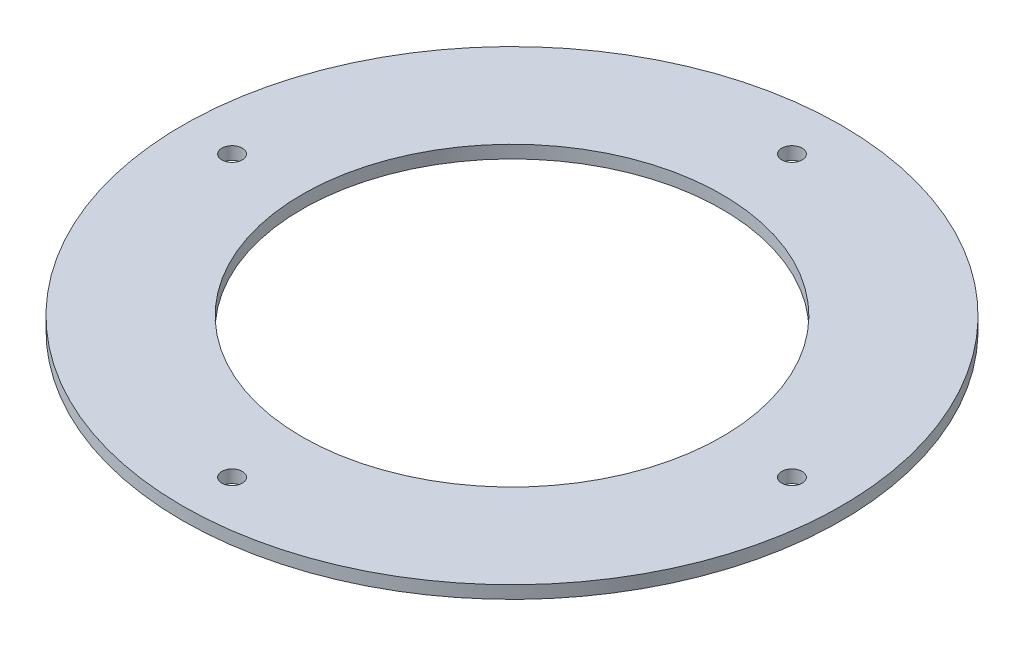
ISO-10303-21;
HEADER;
FILE_DESCRIPTION(('STEP AP214'),'2;1');
FILE_NAME('part.step','',(''),(''),'','','');
FILE_SCHEMA(('AUTOMOTIVE_DESIGN { 1 0 10303 214 1 1 1 1 }'));
ENDSEC;
DATA;
#1=APPLICATION_CONTEXT('core data for automotive mechanical design processes');
#2=APPLICATION_PROTOCOL_DEFINITION('international standard','automotive_design',2000,#1);
#3=PRODUCT_CONTEXT('',#1,'mechanical');
#4=PRODUCT('Part','Part','',(#3));
#5=PRODUCT_RELATED_PRODUCT_CATEGORY('part','',(#4));
#6=PRODUCT_DEFINITION_FORMATION('','',#4);
#7=PRODUCT_DEFINITION_CONTEXT('part definition',#1,'design');
#8=PRODUCT_DEFINITION('design','',#6,#7);
#9=PRODUCT_DEFINITION_SHAPE('','',#8);
#10=(LENGTH_UNIT() NAMED_UNIT(*) SI_UNIT(.MILLI.,.METRE.));
#11=(NAMED_UNIT(*) PLANE_ANGLE_UNIT() SI_UNIT($,.RADIAN.));
#12=(NAMED_UNIT(*) SI_UNIT($,.STERADIAN.) SOLID_ANGLE_UNIT());
#13=UNCERTAINTY_MEASURE_WITH_UNIT(LENGTH_MEASURE(1.E-05),#10,'distance_accuracy_value','');
#14=(GEOMETRIC_REPRESENTATION_CONTEXT(3) GLOBAL_UNCERTAINTY_ASSIGNED_CONTEXT((#13)) GLOBAL_UNIT_ASSIGNED_CONTEXT((#10,
#11,#12)) REPRESENTATION_CONTEXT('',''));
#15=CARTESIAN_POINT('',(0.,0.,0.));
#16=DIRECTION('',(0.,0.,1.));
#17=DIRECTION('',(1.,0.,0.));
#18=AXIS2_PLACEMENT_3D('',#15,#16,#17);
#19=CARTESIAN_POINT('',(0.,3.175,0.));
#20=DIRECTION('',(0.,1.,0.));
#21=DIRECTION('',(0.,0.,1.));
#22=AXIS2_PLACEMENT_3D('',#19,#20,#21);
#23=PLANE('',#22);
#24=CARTESIAN_POINT('',(0.,3.175,-69.85));
#25=DIRECTION('',(0.,1.,0.));
#26=DIRECTION('',(0.,0.,1.));
#27=AXIS2_PLACEMENT_3D('',#24,#25,#26);
#28=CIRCLE('',#27,2.55269999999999);
#29=CARTESIAN_POINT('',(0.,3.175,-67.2973));
#30=VERTEX_POINT('',#29);
#31=EDGE_CURVE('E70',#30,#30,#28,.T.);
#32=ORIENTED_EDGE('',*,*,#31,.F.);
#33=EDGE_LOOP('',(#32));
#34=FACE_BOUND('',#33,.T.);
#35=CARTESIAN_POINT('',(69.85,3.175,2.3566259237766E-13));
#36=DIRECTION('',(0.,1.,0.));
#37=DIRECTION('',(0.,0.,1.));
#38=AXIS2_PLACEMENT_3D('',#35,#36,#37);
#39=CIRCLE('',#38,2.55269999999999);
#40=CARTESIAN_POINT('',(69.85,3.175,2.55270000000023));
#41=VERTEX_POINT('',#40);
#42=EDGE_CURVE('E64',#41,#41,#39,.T.);
#43=ORIENTED_EDGE('',*,*,#42,.F.);
#44=EDGE_LOOP('',(#43));
#45=FACE_BOUND('',#44,.T.);
#46=CARTESIAN_POINT('',(-4.79542563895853E-13,3.175,69.85));
#47=DIRECTION('',(0.,1.,0.));
#48=DIRECTION('',(0.,0.,1.));
#49=AXIS2_PLACEMENT_3D('',#46,#47,#48);
#50=CIRCLE('',#49,2.55269999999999);
#51=CARTESIAN_POINT('',(-4.79542563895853E-13,3.175,72.4027));
#52=VERTEX_POINT('',#51);
#53=EDGE_CURVE('E58',#52,#52,#50,.T.);
#54=ORIENTED_EDGE('',*,*,#53,.F.);
#55=EDGE_LOOP('',(#54));
#56=FACE_BOUND('',#55,.T.);
#57=CARTESIAN_POINT('',(-69.85,3.175,-7.23422535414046E-13));
#58=DIRECTION('',(0.,1.,0.));
#59=DIRECTION('',(0.,0.,1.));
#60=AXIS2_PLACEMENT_3D('',#57,#58,#59);
#61=CIRCLE('',#60,2.55269999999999);
#62=CARTESIAN_POINT('',(-69.85,3.175,2.55269999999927));
#63=VERTEX_POINT('',#62);
#64=EDGE_CURVE('E52',#63,#63,#61,.T.);
#65=ORIENTED_EDGE('',*,*,#64,.F.);
#66=EDGE_LOOP('',(#65));
#67=FACE_BOUND('',#66,.T.);
#68=CARTESIAN_POINT('',(0.,3.175,0.));
#69=DIRECTION('',(0.,1.,0.));
#70=DIRECTION('',(0.,0.,1.));
#71=AXIS2_PLACEMENT_3D('',#68,#69,#70);
#72=CIRCLE('',#71,82.2325);
#73=CARTESIAN_POINT('',(0.,3.175,82.2325));
#74=VERTEX_POINT('',#73);
#75=EDGE_CURVE('E10',#74,#74,#72,.T.);
#76=ORIENTED_EDGE('',*,*,#75,.T.);
#77=EDGE_LOOP('',(#76));
#78=FACE_BOUND('',#77,.T.);
#79=CARTESIAN_POINT('',(0.,3.175,0.));
#80=DIRECTION('',(0.,1.,0.));
#81=DIRECTION('',(0.,0.,1.));
#82=AXIS2_PLACEMENT_3D('',#79,#80,#81);
#83=CIRCLE('',#82,52.3875);
#84=CARTESIAN_POINT('',(0.,3.175,52.3875));
#85=VERTEX_POINT('',#84);
#86=EDGE_CURVE('E42',#85,#85,#83,.T.);
#87=ORIENTED_EDGE('',*,*,#86,.F.);
#88=EDGE_LOOP('',(#87));
#89=FACE_BOUND('',#88,.T.);
#90=ADVANCED_FACE('F31',(#34,#45,#56,#67,#78,#89),#23,.T.);
#91=CARTESIAN_POINT('',(0.,0.,0.));
#92=DIRECTION('',(0.,1.,0.));
#93=DIRECTION('',(0.,0.,1.));
#94=AXIS2_PLACEMENT_3D('',#91,#92,#93);
#95=PLANE('',#94);
#96=CARTESIAN_POINT('',(0.,0.,-69.85));
#97=DIRECTION('',(0.,1.,0.));
#98=DIRECTION('',(0.,0.,1.));
#99=AXIS2_PLACEMENT_3D('',#96,#97,#98);
#100=CIRCLE('',#99,2.5527);
#101=CARTESIAN_POINT('',(0.,0.,-67.2973));
#102=VERTEX_POINT('',#101);
#103=EDGE_CURVE('E67',#102,#102,#100,.T.);
#104=ORIENTED_EDGE('',*,*,#103,.T.);
#105=EDGE_LOOP('',(#104));
#106=FACE_BOUND('',#105,.T.);
#107=CARTESIAN_POINT('',(69.85,0.,2.3566259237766E-13));
#108=DIRECTION('',(0.,1.,0.));
#109=DIRECTION('',(0.,0.,1.));
#110=AXIS2_PLACEMENT_3D('',#107,#108,#109);
#111=CIRCLE('',#110,2.55270000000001);
#112=CARTESIAN_POINT('',(69.85,0.,2.55270000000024));
#113=VERTEX_POINT('',#112);
#114=EDGE_CURVE('E61',#113,#113,#111,.T.);
#115=ORIENTED_EDGE('',*,*,#114,.T.);
#116=EDGE_LOOP('',(#115));
#117=FACE_BOUND('',#116,.T.);
#118=CARTESIAN_POINT('',(-4.79542563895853E-13,0.,69.85));
#119=DIRECTION('',(0.,1.,0.));
#120=DIRECTION('',(0.,0.,1.));
#121=AXIS2_PLACEMENT_3D('',#118,#119,#120);
#122=CIRCLE('',#121,2.5527);
#123=CARTESIAN_POINT('',(-4.79542563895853E-13,0.,72.4027));
#124=VERTEX_POINT('',#123);
#125=EDGE_CURVE('E55',#124,#124,#122,.T.);
#126=ORIENTED_EDGE('',*,*,#125,.T.);
#127=EDGE_LOOP('',(#126));
#128=FACE_BOUND('',#127,.T.);
#129=CARTESIAN_POINT('',(-69.85,0.,-7.23422535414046E-13));
#130=DIRECTION('',(0.,1.,0.));
#131=DIRECTION('',(0.,0.,1.));
#132=AXIS2_PLACEMENT_3D('',#129,#130,#131);
#133=CIRCLE('',#132,2.55270000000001);
#134=CARTESIAN_POINT('',(-69.85,0.,2.55269999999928));
#135=VERTEX_POINT('',#134);
#136=EDGE_CURVE('E47',#135,#135,#133,.T.);
#137=ORIENTED_EDGE('',*,*,#136,.T.);
#138=EDGE_LOOP('',(#137));
#139=FACE_BOUND('',#138,.T.);
#140=CARTESIAN_POINT('',(0.,0.,0.));
#141=DIRECTION('',(0.,1.,0.));
#142=DIRECTION('',(0.,0.,1.));
#143=AXIS2_PLACEMENT_3D('',#140,#141,#142);
#144=CIRCLE('',#143,82.2325);
#145=CARTESIAN_POINT('',(0.,0.,82.2325));
#146=VERTEX_POINT('',#145);
#147=EDGE_CURVE('E35',#146,#146,#144,.T.);
#148=ORIENTED_EDGE('',*,*,#147,.F.);
#149=EDGE_LOOP('',(#148));
#150=FACE_BOUND('',#149,.T.);
#151=CARTESIAN_POINT('',(0.,0.,0.));
#152=DIRECTION('',(0.,1.,0.));
#153=DIRECTION('',(0.,0.,1.));
#154=AXIS2_PLACEMENT_3D('',#151,#152,#153);
#155=CIRCLE('',#154,52.3875);
#156=CARTESIAN_POINT('',(0.,0.,52.3875));
#157=VERTEX_POINT('',#156);
#158=EDGE_CURVE('E44',#157,#157,#155,.T.);
#159=ORIENTED_EDGE('',*,*,#158,.T.);
#160=EDGE_LOOP('',(#159));
#161=FACE_BOUND('',#160,.T.);
#162=ADVANCED_FACE('F78',(#106,#117,#128,#139,#150,#161),#95,.F.);
#163=CARTESIAN_POINT('',(0.,3.175,0.));
#164=DIRECTION('',(0.,-1.,0.));
#165=DIRECTION('',(0.,0.,-1.));
#166=AXIS2_PLACEMENT_3D('',#163,#164,#165);
#167=CYLINDRICAL_SURFACE('',#166,82.2325);
#168=ORIENTED_EDGE('',*,*,#75,.F.);
#169=EDGE_LOOP('',(#168));
#170=FACE_BOUND('',#169,.T.);
#171=ORIENTED_EDGE('',*,*,#147,.T.);
#172=EDGE_LOOP('',(#171));
#173=FACE_BOUND('',#172,.T.);
#174=ADVANCED_FACE('F33',(#170,#173),#167,.T.);
#175=CARTESIAN_POINT('',(0.,3.175,0.));
#176=DIRECTION('',(0.,-1.,0.));
#177=DIRECTION('',(0.,0.,-1.));
#178=AXIS2_PLACEMENT_3D('',#175,#176,#177);
#179=CYLINDRICAL_SURFACE('',#178,52.3875);
#180=ORIENTED_EDGE('',*,*,#86,.T.);
#181=EDGE_LOOP('',(#180));
#182=FACE_BOUND('',#181,.T.);
#183=ORIENTED_EDGE('',*,*,#158,.F.);
#184=EDGE_LOOP('',(#183));
#185=FACE_BOUND('',#184,.T.);
#186=ADVANCED_FACE('F88',(#182,#185),#179,.F.);
#187=CARTESIAN_POINT('',(-69.85,3.175,-7.23422535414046E-13));
#188=DIRECTION('',(0.,1.,0.));
#189=DIRECTION('',(0.,0.,1.));
#190=AXIS2_PLACEMENT_3D('',#187,#188,#189);
#191=CYLINDRICAL_SURFACE('',#190,2.5527);
#192=ORIENTED_EDGE('',*,*,#136,.F.);
#193=EDGE_LOOP('',(#192));
#194=FACE_BOUND('',#193,.T.);
#195=ORIENTED_EDGE('',*,*,#64,.T.);
#196=EDGE_LOOP('',(#195));
#197=FACE_BOUND('',#196,.T.);
#198=ADVANCED_FACE('F91',(#194,#197),#191,.F.);
#199=CARTESIAN_POINT('',(-4.79542563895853E-13,3.175,69.85));
#200=DIRECTION('',(0.,1.,0.));
#201=DIRECTION('',(0.,0.,1.));
#202=AXIS2_PLACEMENT_3D('',#199,#200,#201);
#203=CYLINDRICAL_SURFACE('',#202,2.55269999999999);
#204=ORIENTED_EDGE('',*,*,#125,.F.);
#205=EDGE_LOOP('',(#204));
#206=FACE_BOUND('',#205,.T.);
#207=ORIENTED_EDGE('',*,*,#53,.T.);
#208=EDGE_LOOP('',(#207));
#209=FACE_BOUND('',#208,.T.);
#210=ADVANCED_FACE('F105',(#206,#209),#203,.F.);
#211=CARTESIAN_POINT('',(69.85,3.175,2.3566259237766E-13));
#212=DIRECTION('',(0.,1.,0.));
#213=DIRECTION('',(0.,0.,1.));
#214=AXIS2_PLACEMENT_3D('',#211,#212,#213);
#215=CYLINDRICAL_SURFACE('',#214,2.5527);
#216=ORIENTED_EDGE('',*,*,#114,.F.);
#217=EDGE_LOOP('',(#216));
#218=FACE_BOUND('',#217,.T.);
#219=ORIENTED_EDGE('',*,*,#42,.T.);
#220=EDGE_LOOP('',(#219));
#221=FACE_BOUND('',#220,.T.);
#222=ADVANCED_FACE('F109',(#218,#221),#215,.F.);
#223=CARTESIAN_POINT('',(0.,3.175,-69.85));
#224=DIRECTION('',(0.,1.,0.));
#225=DIRECTION('',(0.,0.,1.));
#226=AXIS2_PLACEMENT_3D('',#223,#224,#225);
#227=CYLINDRICAL_SURFACE('',#226,2.55269999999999);
#228=ORIENTED_EDGE('',*,*,#103,.F.);
#229=EDGE_LOOP('',(#228));
#230=FACE_BOUND('',#229,.T.);
#231=ORIENTED_EDGE('',*,*,#31,.T.);
#232=EDGE_LOOP('',(#231));
#233=FACE_BOUND('',#232,.T.);
#234=ADVANCED_FACE('F74',(#230,#233),#227,.F.);
#235=CLOSED_SHELL('',(#90,#162,#174,#186,#198,#210,#222,#234));
#236=MANIFOLD_SOLID_BREP('B2',#235);
#237=ADVANCED_BREP_SHAPE_REPRESENTATION('',(#18,#236),#14);
#238=SHAPE_DEFINITION_REPRESENTATION(#9,#237);
ENDSEC;
END-ISO-10303-21;
